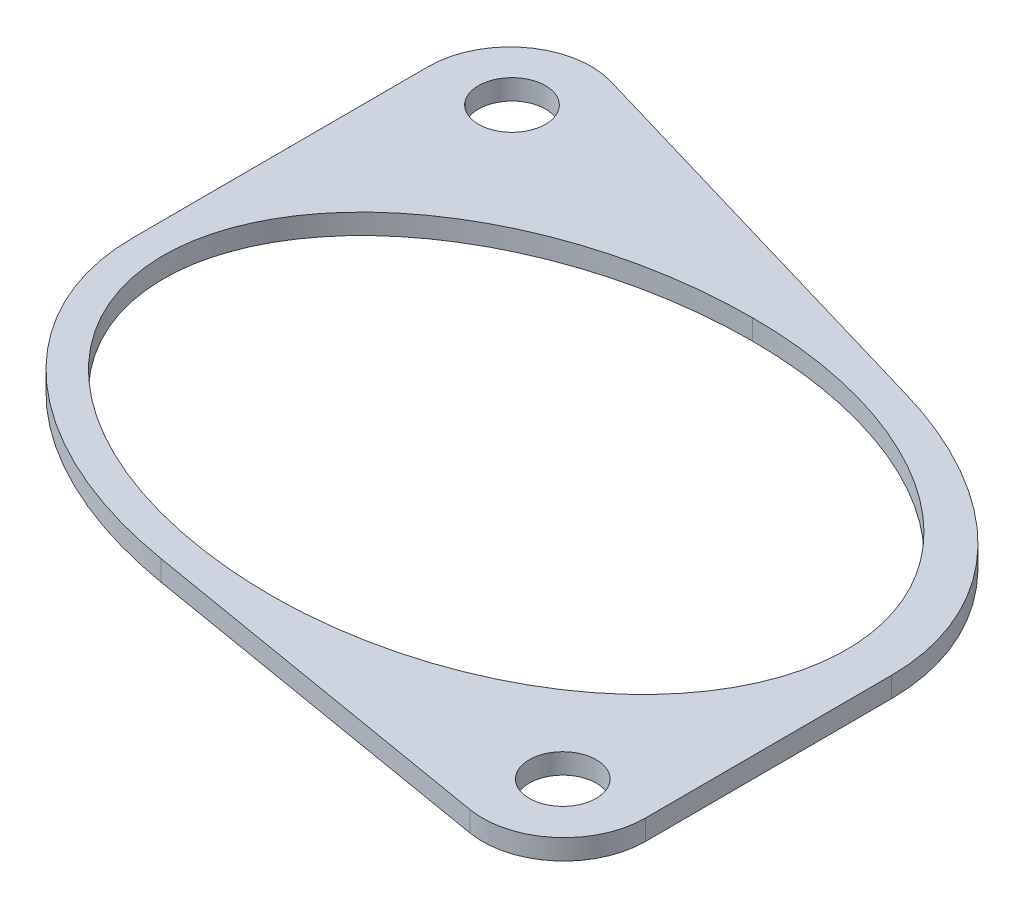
ISO-10303-21;
HEADER;
FILE_DESCRIPTION(('STEP AP214'),'2;1');
FILE_NAME('part.step','',(''),(''),'','','');
FILE_SCHEMA(('AUTOMOTIVE_DESIGN { 1 0 10303 214 1 1 1 1 }'));
ENDSEC;
DATA;
#1=APPLICATION_CONTEXT('core data for automotive mechanical design processes');
#2=APPLICATION_PROTOCOL_DEFINITION('international standard','automotive_design',2000,#1);
#3=PRODUCT_CONTEXT('',#1,'mechanical');
#4=PRODUCT('Part','Part','',(#3));
#5=PRODUCT_RELATED_PRODUCT_CATEGORY('part','',(#4));
#6=PRODUCT_DEFINITION_FORMATION('','',#4);
#7=PRODUCT_DEFINITION_CONTEXT('part definition',#1,'design');
#8=PRODUCT_DEFINITION('design','',#6,#7);
#9=PRODUCT_DEFINITION_SHAPE('','',#8);
#10=(LENGTH_UNIT() NAMED_UNIT(*) SI_UNIT(.MILLI.,.METRE.));
#11=(NAMED_UNIT(*) PLANE_ANGLE_UNIT() SI_UNIT($,.RADIAN.));
#12=(NAMED_UNIT(*) SI_UNIT($,.STERADIAN.) SOLID_ANGLE_UNIT());
#13=UNCERTAINTY_MEASURE_WITH_UNIT(LENGTH_MEASURE(1.E-05),#10,'distance_accuracy_value','');
#14=(GEOMETRIC_REPRESENTATION_CONTEXT(3) GLOBAL_UNCERTAINTY_ASSIGNED_CONTEXT((#13)) GLOBAL_UNIT_ASSIGNED_CONTEXT((#10,
#11,#12)) REPRESENTATION_CONTEXT('',''));
#15=CARTESIAN_POINT('',(0.,0.,0.));
#16=DIRECTION('',(0.,0.,1.));
#17=DIRECTION('',(1.,0.,0.));
#18=AXIS2_PLACEMENT_3D('',#15,#16,#17);
#19=CARTESIAN_POINT('',(0.,1.,0.));
#20=DIRECTION('',(0.,1.,0.));
#21=DIRECTION('',(-1.,0.,0.));
#22=AXIS2_PLACEMENT_3D('',#19,#20,#21);
#23=ELLIPSE('',#22,17.17,11.85);
#24=DIRECTION('',(0.,-1.,0.));
#25=VECTOR('',#24,1.);
#26=SURFACE_OF_LINEAR_EXTRUSION('',#23,#25);
#27=CARTESIAN_POINT('',(0.,0.,0.));
#28=DIRECTION('',(0.,1.,0.));
#29=DIRECTION('',(-1.,0.,0.));
#30=AXIS2_PLACEMENT_3D('',#27,#28,#29);
#31=ELLIPSE('',#30,17.17,11.85);
#32=CARTESIAN_POINT('',(0.,0.,-11.85));
#33=VERTEX_POINT('',#32);
#34=CARTESIAN_POINT('',(0.,0.,11.85));
#35=VERTEX_POINT('',#34);
#36=EDGE_CURVE('E185',#33,#35,#31,.T.);
#37=ORIENTED_EDGE('',*,*,#36,.F.);
#38=DIRECTION('',(0.,-1.,0.));
#39=VECTOR('',#38,1.);
#40=CARTESIAN_POINT('',(0.,1.,-11.85));
#41=LINE('',#40,#39);
#42=CARTESIAN_POINT('',(0.,1.,-11.85));
#43=VERTEX_POINT('',#42);
#44=EDGE_CURVE('E147',#43,#33,#41,.T.);
#45=ORIENTED_EDGE('',*,*,#44,.F.);
#46=CARTESIAN_POINT('',(0.,1.,11.85));
#47=VERTEX_POINT('',#46);
#48=EDGE_CURVE('E257',#43,#47,#23,.T.);
#49=ORIENTED_EDGE('',*,*,#48,.T.);
#50=DIRECTION('',(0.,-1.,0.));
#51=VECTOR('',#50,1.);
#52=CARTESIAN_POINT('',(0.,1.,11.85));
#53=LINE('',#52,#51);
#54=EDGE_CURVE('E145',#47,#35,#53,.T.);
#55=ORIENTED_EDGE('',*,*,#54,.T.);
#56=EDGE_LOOP('',(#37,#45,#49,#55));
#57=FACE_BOUND('',#56,.T.);
#58=ADVANCED_FACE('F45',(#57),#26,.T.);
#59=CARTESIAN_POINT('',(-18.6699444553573,1.,0.0373253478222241));
#60=DIRECTION('',(0.999998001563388,0.,-0.00199921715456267));
#61=DIRECTION('',(-0.00199921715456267,0.,-0.999998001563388));
#62=AXIS2_PLACEMENT_3D('',#59,#60,#61);
#63=PLANE('',#62);
#64=DIRECTION('',(0.00199921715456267,0.,0.999998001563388));
#65=VECTOR('',#64,1.);
#66=CARTESIAN_POINT('',(-18.6699444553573,1.,0.0373253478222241));
#67=LINE('',#66,#65);
#68=CARTESIAN_POINT('',(-18.6991890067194,1.,-14.5906468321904));
#69=VERTEX_POINT('',#68);
#70=CARTESIAN_POINT('',(-18.6699809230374,1.,0.0190844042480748));
#71=VERTEX_POINT('',#70);
#72=EDGE_CURVE('E119',#69,#71,#67,.T.);
#73=ORIENTED_EDGE('',*,*,#72,.F.);
#74=DIRECTION('',(0.,-1.,0.));
#75=VECTOR('',#74,1.);
#76=CARTESIAN_POINT('',(-18.6991890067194,0.,-14.5906468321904));
#77=LINE('',#76,#75);
#78=CARTESIAN_POINT('',(-18.6991890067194,0.,-14.5906468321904));
#79=VERTEX_POINT('',#78);
#80=EDGE_CURVE('E53',#69,#79,#77,.T.);
#81=ORIENTED_EDGE('',*,*,#80,.T.);
#82=DIRECTION('',(0.00199921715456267,0.,0.999998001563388));
#83=VECTOR('',#82,1.);
#84=CARTESIAN_POINT('',(-18.6699444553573,0.,0.0373253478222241));
#85=LINE('',#84,#83);
#86=CARTESIAN_POINT('',(-18.6699809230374,0.,0.0190844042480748));
#87=VERTEX_POINT('',#86);
#88=EDGE_CURVE('E143',#79,#87,#85,.T.);
#89=ORIENTED_EDGE('',*,*,#88,.T.);
#90=DIRECTION('',(0.,-1.,0.));
#91=VECTOR('',#90,1.);
#92=CARTESIAN_POINT('',(-18.6699809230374,1.,0.0190844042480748));
#93=LINE('',#92,#91);
#94=EDGE_CURVE('E136',#71,#87,#93,.T.);
#95=ORIENTED_EDGE('',*,*,#94,.F.);
#96=EDGE_LOOP('',(#73,#81,#89,#95));
#97=FACE_BOUND('',#96,.T.);
#98=ADVANCED_FACE('F141',(#97),#63,.F.);
#99=CARTESIAN_POINT('',(0.,1.,0.));
#100=DIRECTION('',(0.,1.,0.));
#101=DIRECTION('',(1.,0.,0.));
#102=AXIS2_PLACEMENT_3D('',#99,#100,#101);
#103=ELLIPSE('',#102,18.67,13.35);
#104=DIRECTION('',(0.,-1.,0.));
#105=VECTOR('',#104,1.);
#106=SURFACE_OF_LINEAR_EXTRUSION('',#103,#105);
#107=CARTESIAN_POINT('',(0.,0.,0.));
#108=DIRECTION('',(0.,1.,0.));
#109=DIRECTION('',(1.,0.,0.));
#110=AXIS2_PLACEMENT_3D('',#107,#108,#109);
#111=ELLIPSE('',#110,18.67,13.35);
#112=CARTESIAN_POINT('',(-4.29385810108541,0.,12.9921357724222));
#113=VERTEX_POINT('',#112);
#114=EDGE_CURVE('E169',#87,#113,#111,.T.);
#115=ORIENTED_EDGE('',*,*,#114,.T.);
#116=DIRECTION('',(0.,-1.,0.));
#117=VECTOR('',#116,1.);
#118=CARTESIAN_POINT('',(-4.29385810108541,1.,12.9921357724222));
#119=LINE('',#118,#117);
#120=CARTESIAN_POINT('',(-4.29385810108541,1.,12.9921357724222));
#121=VERTEX_POINT('',#120);
#122=EDGE_CURVE('E138',#121,#113,#119,.T.);
#123=ORIENTED_EDGE('',*,*,#122,.F.);
#124=EDGE_CURVE('E124',#71,#121,#103,.T.);
#125=ORIENTED_EDGE('',*,*,#124,.F.);
#126=ORIENTED_EDGE('',*,*,#94,.T.);
#127=EDGE_LOOP('',(#115,#123,#125,#126));
#128=FACE_BOUND('',#127,.T.);
#129=ADVANCED_FACE('F135',(#128),#106,.F.);
#130=CARTESIAN_POINT('',(-2.25369684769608,1.,13.3368867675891));
#131=DIRECTION('',(-0.166620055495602,0.,0.986021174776));
#132=DIRECTION('',(0.986021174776,0.,0.166620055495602));
#133=AXIS2_PLACEMENT_3D('',#130,#131,#132);
#134=PLANE('',#133);
#135=DIRECTION('',(-0.986021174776,0.,-0.166620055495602));
#136=VECTOR('',#135,1.);
#137=CARTESIAN_POINT('',(-2.25369684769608,0.,13.3368867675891));
#138=LINE('',#137,#136);
#139=CARTESIAN_POINT('',(14.0326671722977,0.,16.0889928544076));
#140=VERTEX_POINT('',#139);
#141=EDGE_CURVE('E171',#140,#113,#138,.T.);
#142=ORIENTED_EDGE('',*,*,#141,.F.);
#143=DIRECTION('',(0.,-1.,0.));
#144=VECTOR('',#143,1.);
#145=CARTESIAN_POINT('',(14.0326671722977,1.,16.0889928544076));
#146=LINE('',#145,#144);
#147=CARTESIAN_POINT('',(14.0326671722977,1.,16.0889928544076));
#148=VERTEX_POINT('',#147);
#149=EDGE_CURVE('E160',#140,#148,#146,.F.);
#150=ORIENTED_EDGE('',*,*,#149,.T.);
#151=DIRECTION('',(-0.986021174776,0.,-0.166620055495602));
#152=VECTOR('',#151,1.);
#153=CARTESIAN_POINT('',(-2.25369684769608,1.,13.3368867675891));
#154=LINE('',#153,#152);
#155=EDGE_CURVE('E139',#148,#121,#154,.T.);
#156=ORIENTED_EDGE('',*,*,#155,.T.);
#157=ORIENTED_EDGE('',*,*,#122,.T.);
#158=EDGE_LOOP('',(#142,#150,#156,#157));
#159=FACE_BOUND('',#158,.T.);
#160=ADVANCED_FACE('F219',(#159),#134,.T.);
#161=CARTESIAN_POINT('',(18.6699200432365,1.,-0.0447826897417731));
#162=DIRECTION('',(0.99999712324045,0.,-0.00239864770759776));
#163=DIRECTION('',(-0.00239864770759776,0.,-0.99999712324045));
#164=AXIS2_PLACEMENT_3D('',#161,#162,#163);
#165=PLANE('',#164);
#166=DIRECTION('',(0.00239864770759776,0.,0.99999712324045));
#167=VECTOR('',#166,1.);
#168=CARTESIAN_POINT('',(18.6699200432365,1.,-0.0447826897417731));
#169=LINE('',#168,#167);
#170=CARTESIAN_POINT('',(18.6699725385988,1.,-0.0228973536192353));
#171=VERTEX_POINT('',#170);
#172=CARTESIAN_POINT('',(18.6991358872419,1.,12.1353135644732));
#173=VERTEX_POINT('',#172);
#174=EDGE_CURVE('E212',#171,#173,#169,.T.);
#175=ORIENTED_EDGE('',*,*,#174,.T.);
#176=DIRECTION('',(0.,-1.,0.));
#177=VECTOR('',#176,1.);
#178=CARTESIAN_POINT('',(18.6991358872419,1.,12.1353135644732));
#179=LINE('',#178,#177);
#180=CARTESIAN_POINT('',(18.6991358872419,0.,12.1353135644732));
#181=VERTEX_POINT('',#180);
#182=EDGE_CURVE('E153',#173,#181,#179,.T.);
#183=ORIENTED_EDGE('',*,*,#182,.T.);
#184=DIRECTION('',(0.00239864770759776,0.,0.99999712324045));
#185=VECTOR('',#184,1.);
#186=CARTESIAN_POINT('',(18.6699200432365,0.,-0.0447826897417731));
#187=LINE('',#186,#185);
#188=CARTESIAN_POINT('',(18.6699725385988,0.,-0.0228973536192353));
#189=VERTEX_POINT('',#188);
#190=EDGE_CURVE('E178',#189,#181,#187,.T.);
#191=ORIENTED_EDGE('',*,*,#190,.F.);
#192=DIRECTION('',(0.,-1.,0.));
#193=VECTOR('',#192,1.);
#194=CARTESIAN_POINT('',(18.6699725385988,1.,-0.0228973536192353));
#195=LINE('',#194,#193);
#196=EDGE_CURVE('E149',#171,#189,#195,.T.);
#197=ORIENTED_EDGE('',*,*,#196,.F.);
#198=EDGE_LOOP('',(#175,#183,#191,#197));
#199=FACE_BOUND('',#198,.T.);
#200=ADVANCED_FACE('F210',(#199),#165,.T.);
#201=CARTESIAN_POINT('',(0.,1.,0.));
#202=DIRECTION('',(0.,1.,0.));
#203=DIRECTION('',(1.,0.,0.));
#204=AXIS2_PLACEMENT_3D('',#201,#202,#203);
#205=ELLIPSE('',#204,18.67,13.35);
#206=DIRECTION('',(0.,-1.,0.));
#207=VECTOR('',#206,1.);
#208=SURFACE_OF_LINEAR_EXTRUSION('',#205,#207);
#209=CARTESIAN_POINT('',(0.,0.,0.));
#210=DIRECTION('',(0.,1.,0.));
#211=DIRECTION('',(1.,0.,0.));
#212=AXIS2_PLACEMENT_3D('',#209,#210,#211);
#213=ELLIPSE('',#212,18.67,13.35);
#214=CARTESIAN_POINT('',(7.11163391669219,0.,-12.3435587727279));
#215=VERTEX_POINT('',#214);
#216=EDGE_CURVE('E180',#189,#215,#213,.T.);
#217=ORIENTED_EDGE('',*,*,#216,.T.);
#218=DIRECTION('',(0.,-1.,0.));
#219=VECTOR('',#218,1.);
#220=CARTESIAN_POINT('',(7.11163391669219,1.,-12.3435587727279));
#221=LINE('',#220,#219);
#222=CARTESIAN_POINT('',(7.11163391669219,1.,-12.3435587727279));
#223=VERTEX_POINT('',#222);
#224=EDGE_CURVE('E197',#223,#215,#221,.T.);
#225=ORIENTED_EDGE('',*,*,#224,.F.);
#226=EDGE_CURVE('E205',#171,#223,#205,.T.);
#227=ORIENTED_EDGE('',*,*,#226,.F.);
#228=ORIENTED_EDGE('',*,*,#196,.T.);
#229=EDGE_LOOP('',(#217,#225,#227,#228));
#230=FACE_BOUND('',#229,.T.);
#231=ADVANCED_FACE('F202',(#230),#208,.F.);
#232=CARTESIAN_POINT('',(15.,1.,12.5));
#233=DIRECTION('',(0.,-1.,0.));
#234=DIRECTION('',(0.,0.,-1.));
#235=AXIS2_PLACEMENT_3D('',#232,#233,#234);
#236=CYLINDRICAL_SURFACE('',#235,1.65);
#237=CARTESIAN_POINT('',(15.,1.,12.5));
#238=DIRECTION('',(0.,1.,0.));
#239=DIRECTION('',(0.,0.,1.));
#240=AXIS2_PLACEMENT_3D('',#237,#238,#239);
#241=CIRCLE('',#240,1.65);
#242=CARTESIAN_POINT('',(15.,1.,14.15));
#243=VERTEX_POINT('',#242);
#244=EDGE_CURVE('E262',#243,#243,#241,.T.);
#245=ORIENTED_EDGE('',*,*,#244,.T.);
#246=EDGE_LOOP('',(#245));
#247=FACE_BOUND('',#246,.T.);
#248=CARTESIAN_POINT('',(15.,0.,12.5));
#249=DIRECTION('',(0.,1.,0.));
#250=DIRECTION('',(0.,0.,1.));
#251=AXIS2_PLACEMENT_3D('',#248,#249,#250);
#252=CIRCLE('',#251,1.65);
#253=CARTESIAN_POINT('',(15.,0.,14.15));
#254=VERTEX_POINT('',#253);
#255=EDGE_CURVE('E191',#254,#254,#252,.T.);
#256=ORIENTED_EDGE('',*,*,#255,.F.);
#257=EDGE_LOOP('',(#256));
#258=FACE_BOUND('',#257,.T.);
#259=ADVANCED_FACE('F232',(#247,#258),#236,.F.);
#260=CARTESIAN_POINT('',(0.,1.,0.));
#261=DIRECTION('',(0.,-1.,0.));
#262=DIRECTION('',(1.,0.,0.));
#263=AXIS2_PLACEMENT_3D('',#260,#261,#262);
#264=ELLIPSE('',#263,16.47,11.85);
#265=DIRECTION('',(0.,-1.,0.));
#266=VECTOR('',#265,1.);
#267=SURFACE_OF_LINEAR_EXTRUSION('',#264,#266);
#268=CARTESIAN_POINT('',(0.,0.,0.));
#269=DIRECTION('',(0.,-1.,0.));
#270=DIRECTION('',(1.,0.,0.));
#271=AXIS2_PLACEMENT_3D('',#268,#269,#270);
#272=ELLIPSE('',#271,16.47,11.85);
#273=EDGE_CURVE('E188',#33,#35,#272,.T.);
#274=ORIENTED_EDGE('',*,*,#273,.T.);
#275=ORIENTED_EDGE('',*,*,#54,.F.);
#276=EDGE_CURVE('E260',#43,#47,#264,.T.);
#277=ORIENTED_EDGE('',*,*,#276,.F.);
#278=ORIENTED_EDGE('',*,*,#44,.T.);
#279=EDGE_LOOP('',(#274,#275,#277,#278));
#280=FACE_BOUND('',#279,.T.);
#281=ADVANCED_FACE('F254',(#280),#267,.F.);
#282=CARTESIAN_POINT('',(3.91367275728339,1.,-13.285613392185));
#283=DIRECTION('',(0.282574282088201,0.,-0.959245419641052));
#284=DIRECTION('',(-0.959245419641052,0.,-0.282574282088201));
#285=AXIS2_PLACEMENT_3D('',#282,#283,#284);
#286=PLANE('',#285);
#287=DIRECTION('',(0.959245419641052,0.,0.282574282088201));
#288=VECTOR('',#287,1.);
#289=CARTESIAN_POINT('',(3.91367275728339,0.,-13.285613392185));
#290=LINE('',#289,#288);
#291=CARTESIAN_POINT('',(-13.568899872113,0.,-18.4356253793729));
#292=VERTEX_POINT('',#291);
#293=EDGE_CURVE('E183',#292,#215,#290,.T.);
#294=ORIENTED_EDGE('',*,*,#293,.F.);
#295=DIRECTION('',(0.,-1.,0.));
#296=VECTOR('',#295,1.);
#297=CARTESIAN_POINT('',(-13.568899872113,1.,-18.4356253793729));
#298=LINE('',#297,#296);
#299=CARTESIAN_POINT('',(-13.568899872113,1.,-18.4356253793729));
#300=VERTEX_POINT('',#299);
#301=EDGE_CURVE('E11',#292,#300,#298,.F.);
#302=ORIENTED_EDGE('',*,*,#301,.T.);
#303=DIRECTION('',(0.959245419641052,0.,0.282574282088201));
#304=VECTOR('',#303,1.);
#305=CARTESIAN_POINT('',(3.91367275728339,1.,-13.285613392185));
#306=LINE('',#305,#304);
#307=EDGE_CURVE('E226',#300,#223,#306,.T.);
#308=ORIENTED_EDGE('',*,*,#307,.T.);
#309=ORIENTED_EDGE('',*,*,#224,.T.);
#310=EDGE_LOOP('',(#294,#302,#308,#309));
#311=FACE_BOUND('',#310,.T.);
#312=ADVANCED_FACE('F233',(#311),#286,.T.);
#313=CARTESIAN_POINT('',(-15.,1.,-15.));
#314=DIRECTION('',(0.,-1.,0.));
#315=DIRECTION('',(0.,0.,-1.));
#316=AXIS2_PLACEMENT_3D('',#313,#314,#315);
#317=CYLINDRICAL_SURFACE('',#316,1.65);
#318=CARTESIAN_POINT('',(-15.,1.,-15.));
#319=DIRECTION('',(0.,1.,0.));
#320=DIRECTION('',(0.,0.,1.));
#321=AXIS2_PLACEMENT_3D('',#318,#319,#320);
#322=CIRCLE('',#321,1.65);
#323=CARTESIAN_POINT('',(-15.,1.,-13.35));
#324=VERTEX_POINT('',#323);
#325=EDGE_CURVE('E174',#324,#324,#322,.T.);
#326=ORIENTED_EDGE('',*,*,#325,.T.);
#327=EDGE_LOOP('',(#326));
#328=FACE_BOUND('',#327,.T.);
#329=CARTESIAN_POINT('',(-15.,0.,-15.));
#330=DIRECTION('',(0.,1.,0.));
#331=DIRECTION('',(0.,0.,1.));
#332=AXIS2_PLACEMENT_3D('',#329,#330,#331);
#333=CIRCLE('',#332,1.65);
#334=CARTESIAN_POINT('',(-15.,0.,-13.35));
#335=VERTEX_POINT('',#334);
#336=EDGE_CURVE('E130',#335,#335,#333,.T.);
#337=ORIENTED_EDGE('',*,*,#336,.F.);
#338=EDGE_LOOP('',(#337));
#339=FACE_BOUND('',#338,.T.);
#340=ADVANCED_FACE('F269',(#328,#339),#317,.F.);
#341=CARTESIAN_POINT('',(0.,1.,0.));
#342=DIRECTION('',(0.,1.,0.));
#343=DIRECTION('',(0.,0.,1.));
#344=AXIS2_PLACEMENT_3D('',#341,#342,#343);
#345=PLANE('',#344);
#346=ORIENTED_EDGE('',*,*,#155,.F.);
#347=CARTESIAN_POINT('',(14.6991473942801,1.,12.1449081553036));
#348=DIRECTION('',(0.,1.,0.));
#349=DIRECTION('',(0.,0.,1.));
#350=AXIS2_PLACEMENT_3D('',#347,#348,#349);
#351=CIRCLE('',#350,4.);
#352=EDGE_CURVE('E163',#148,#173,#351,.T.);
#353=ORIENTED_EDGE('',*,*,#352,.T.);
#354=ORIENTED_EDGE('',*,*,#174,.F.);
#355=ORIENTED_EDGE('',*,*,#226,.T.);
#356=ORIENTED_EDGE('',*,*,#307,.F.);
#357=CARTESIAN_POINT('',(-14.6991970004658,1.,-14.5986437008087));
#358=DIRECTION('',(0.,1.,0.));
#359=DIRECTION('',(0.,0.,1.));
#360=AXIS2_PLACEMENT_3D('',#357,#358,#359);
#361=CIRCLE('',#360,4.);
#362=EDGE_CURVE('E65',#300,#69,#361,.T.);
#363=ORIENTED_EDGE('',*,*,#362,.T.);
#364=ORIENTED_EDGE('',*,*,#72,.T.);
#365=ORIENTED_EDGE('',*,*,#124,.T.);
#366=EDGE_LOOP('',(#346,#353,#354,#355,#356,#363,#364,#365));
#367=FACE_BOUND('',#366,.T.);
#368=ORIENTED_EDGE('',*,*,#48,.F.);
#369=ORIENTED_EDGE('',*,*,#276,.T.);
#370=EDGE_LOOP('',(#368,#369));
#371=FACE_BOUND('',#370,.T.);
#372=ORIENTED_EDGE('',*,*,#244,.F.);
#373=EDGE_LOOP('',(#372));
#374=FACE_BOUND('',#373,.T.);
#375=ORIENTED_EDGE('',*,*,#325,.F.);
#376=EDGE_LOOP('',(#375));
#377=FACE_BOUND('',#376,.T.);
#378=ADVANCED_FACE('F122',(#367,#371,#374,#377),#345,.T.);
#379=CARTESIAN_POINT('',(0.,0.,0.));
#380=DIRECTION('',(0.,1.,0.));
#381=DIRECTION('',(0.,0.,1.));
#382=AXIS2_PLACEMENT_3D('',#379,#380,#381);
#383=PLANE('',#382);
#384=ORIENTED_EDGE('',*,*,#190,.T.);
#385=CARTESIAN_POINT('',(14.6991473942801,0.,12.1449081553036));
#386=DIRECTION('',(0.,1.,0.));
#387=DIRECTION('',(0.,0.,1.));
#388=AXIS2_PLACEMENT_3D('',#385,#386,#387);
#389=CIRCLE('',#388,4.);
#390=EDGE_CURVE('E158',#181,#140,#389,.F.);
#391=ORIENTED_EDGE('',*,*,#390,.T.);
#392=ORIENTED_EDGE('',*,*,#141,.T.);
#393=ORIENTED_EDGE('',*,*,#114,.F.);
#394=ORIENTED_EDGE('',*,*,#88,.F.);
#395=CARTESIAN_POINT('',(-14.6991970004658,0.,-14.5986437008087));
#396=DIRECTION('',(0.,1.,0.));
#397=DIRECTION('',(0.,0.,1.));
#398=AXIS2_PLACEMENT_3D('',#395,#396,#397);
#399=CIRCLE('',#398,4.);
#400=EDGE_CURVE('E156',#79,#292,#399,.F.);
#401=ORIENTED_EDGE('',*,*,#400,.T.);
#402=ORIENTED_EDGE('',*,*,#293,.T.);
#403=ORIENTED_EDGE('',*,*,#216,.F.);
#404=EDGE_LOOP('',(#384,#391,#392,#393,#394,#401,#402,#403));
#405=FACE_BOUND('',#404,.T.);
#406=ORIENTED_EDGE('',*,*,#36,.T.);
#407=ORIENTED_EDGE('',*,*,#273,.F.);
#408=EDGE_LOOP('',(#406,#407));
#409=FACE_BOUND('',#408,.T.);
#410=ORIENTED_EDGE('',*,*,#255,.T.);
#411=EDGE_LOOP('',(#410));
#412=FACE_BOUND('',#411,.T.);
#413=ORIENTED_EDGE('',*,*,#336,.T.);
#414=EDGE_LOOP('',(#413));
#415=FACE_BOUND('',#414,.T.);
#416=ADVANCED_FACE('F167',(#405,#409,#412,#415),#383,.F.);
#417=CARTESIAN_POINT('',(14.6991473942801,1.,12.1449081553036));
#418=DIRECTION('',(0.,-1.,0.));
#419=DIRECTION('',(0.,0.,-1.));
#420=AXIS2_PLACEMENT_3D('',#417,#418,#419);
#421=CYLINDRICAL_SURFACE('',#420,4.);
#422=ORIENTED_EDGE('',*,*,#352,.F.);
#423=ORIENTED_EDGE('',*,*,#149,.F.);
#424=ORIENTED_EDGE('',*,*,#390,.F.);
#425=ORIENTED_EDGE('',*,*,#182,.F.);
#426=EDGE_LOOP('',(#422,#423,#424,#425));
#427=FACE_BOUND('',#426,.T.);
#428=ADVANCED_FACE('F215',(#427),#421,.T.);
#429=CARTESIAN_POINT('',(-14.6991970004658,1.,-14.5986437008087));
#430=DIRECTION('',(0.,1.,0.));
#431=DIRECTION('',(0.,0.,1.));
#432=AXIS2_PLACEMENT_3D('',#429,#430,#431);
#433=CYLINDRICAL_SURFACE('',#432,4.);
#434=ORIENTED_EDGE('',*,*,#362,.F.);
#435=ORIENTED_EDGE('',*,*,#301,.F.);
#436=ORIENTED_EDGE('',*,*,#400,.F.);
#437=ORIENTED_EDGE('',*,*,#80,.F.);
#438=EDGE_LOOP('',(#434,#435,#436,#437));
#439=FACE_BOUND('',#438,.T.);
#440=ADVANCED_FACE('F47',(#439),#433,.T.);
#441=CLOSED_SHELL('',(#58,#98,#129,#160,#200,#231,#259,#281,#312,#340,#378,#416,#428,#440));
#442=MANIFOLD_SOLID_BREP('B2',#441);
#443=ADVANCED_BREP_SHAPE_REPRESENTATION('',(#18,#442),#14);
#444=SHAPE_DEFINITION_REPRESENTATION(#9,#443);
ENDSEC;
END-ISO-10303-21;
